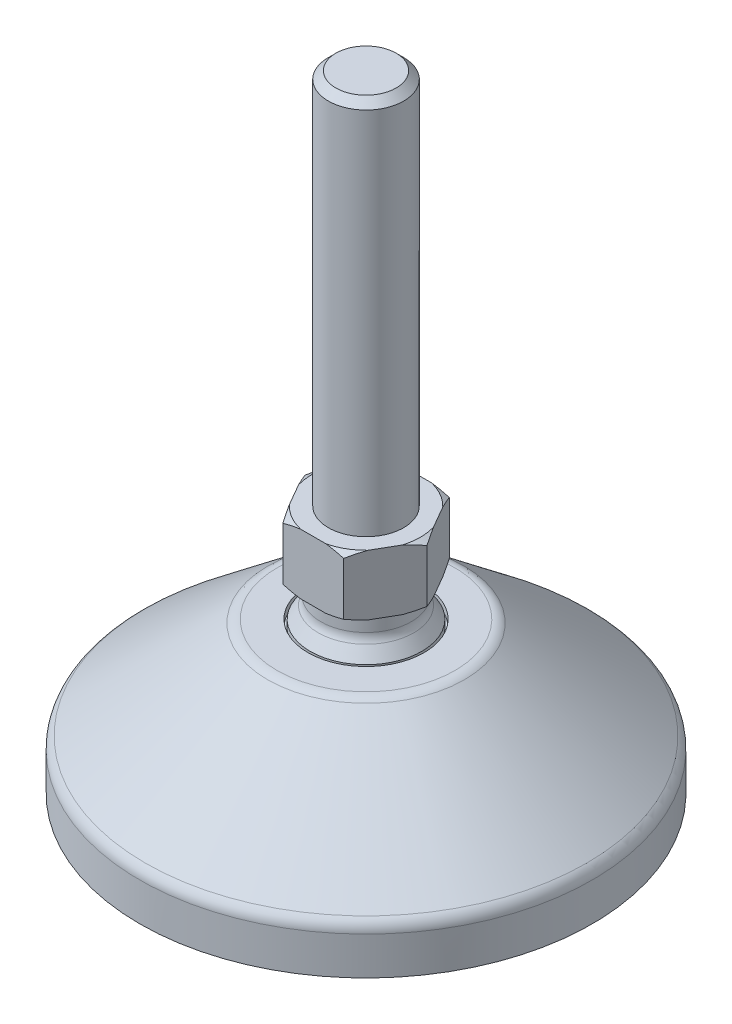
from build123d import *

# Parameters (mm, degrees)
SKETCH1_R           = 25.75
BOSS_EXTRUDE1_DEPTH = 2
SKETCH2_R           = 30
BOSS_EXTRUDE2_DEPTH = 6
SKETCH3_R           = 12.5
SKETCH4_R           = 7.4
SKETCH5_R           = 6
SKETCH11_R          = 7.7
SKETCH11_R_2        = 7.4
CUT_EXTRUDE1_DEPTH  = 1
SKETCH6_R           = 6
BOSS_EXTRUDE3_DEPTH = 2.9
SKETCH7_R           = 5
BOSS_EXTRUDE4_DEPTH = 58
SKETCH8_R           = 5
BOSS_EXTRUDE5_DEPTH = 8
CHAMFER1_SIZE       = 1
BOSS_EXTRUDE6_DEPTH = 1
FILLET1_R           = 2
FILLET2_R           = 2
FILLET3_R           = 1


with BuildPart() as part:
    # Sketch1 → Boss-Extrude1 (new body)
    with BuildSketch(Plane(origin=(0, 0, 0), x_dir=(1, 0, 0), z_dir=(0, 1, 0))):
        with Locations(Location((0, 0, 0), (0, 0, 270))):
            Circle(SKETCH1_R)
    extrude(amount=BOSS_EXTRUDE1_DEPTH)

    # Sketch2 → Boss-Extrude2 (add)
    with BuildSketch(Plane(origin=(0, 2, 0), x_dir=(1, 0, 0), z_dir=(0, 1, 0))):
        with Locations(Location((0, 0, 0), (0, 0, 270))):
            Circle(SKETCH2_R)
    extrude(amount=BOSS_EXTRUDE2_DEPTH)

    # Sketch3 → section 1 of loft1
    with BuildSketch(Plane(origin=(0, 22, 0), x_dir=(1, 0, 0), z_dir=(0, 1, 0)), mode=Mode.PRIVATE) as loft1_s1:
        Circle(SKETCH3_R)
    # loft up to a face of the part (loft1)
    loft([Face(Wire([part.edges().sort_by_distance((21.869058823, 8, -20.536413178))[0]])), loft1_s1.sketch])

    # Sketch4 → Loft2 section 0
    with BuildSketch(Plane(origin=(0, 22, 0), x_dir=(1, 0, 0), z_dir=(0, 1, 0))):
        Circle(SKETCH4_R)
    # Sketch5 → Loft2 section 1
    with BuildSketch(Plane(origin=(0, 24.1, 0), x_dir=(1, 0, 0), z_dir=(0, 1, 0))):
        Circle(SKETCH5_R)
    loft()

    # Sketch11 → Cut-Extrude1 (cut)
    with BuildSketch(Plane(origin=(0, 22, 0), x_dir=(1, 0, 0), z_dir=(0, 1, 0))):
        with Locations(Location((0, 0, 0), (0, 0, 270))):
            Circle(SKETCH11_R)
        with Locations(Location((0, 0, 0), (0, 0, 270))):
            Circle(SKETCH11_R_2, mode=Mode.SUBTRACT)
    extrude(amount=-CUT_EXTRUDE1_DEPTH, mode=Mode.SUBTRACT)

    # Sketch6 → Boss-Extrude3 (add)
    with BuildSketch(Plane(origin=(0, 24.1, 0), x_dir=(1, 0, 0), z_dir=(0, 1, 0))):
        with Locations(Location((0, 0, 0), (0, 0, 270))):
            Circle(SKETCH6_R)
    extrude(amount=BOSS_EXTRUDE3_DEPTH)

    # Sketch7 → Boss-Extrude4 (add)
    with BuildSketch(Plane(origin=(0, 27, 0), x_dir=(1, 0, 0), z_dir=(0, 1, 0))):
        with Locations(Location((0, 0, 0), (0, 0, 90))):
            Circle(SKETCH7_R)
    extrude(amount=BOSS_EXTRUDE4_DEPTH)

    # Sketch8 → Boss-Extrude5 (add)
    with BuildSketch(Plane(origin=(0, 27, 0), x_dir=(1, 0, 0), z_dir=(0, 1, 0))):
        Polygon((8.082903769, 0), (4.041451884, 7), (-4.041451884, 7), (-8.082903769, 0), (-4.041451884, -7), (4.041451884, -7), align=None)
        with Locations(Location((0, 0, 0), (0, 0, 90))):
            Circle(SKETCH8_R, mode=Mode.SUBTRACT)
    extrude(amount=BOSS_EXTRUDE5_DEPTH)

    # Sketch9 → Cut-Revolve1 (revolve, cut)
    with BuildSketch(Plane.XY, mode=Mode.PRIVATE) as cut_revolve1_sk:
        Polygon((-7.2, 35), (-8.082903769, 34.5), (-8.082903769, 35), align=None)
        Polygon((-8.082903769, 27.5), (-7.2, 27), (-8.082903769, 27), align=None)
    revolve(cut_revolve1_sk.sketch.rotate(Axis((0, 85, 0), (0, -1, 0)), 90), axis=Axis((0, 85, 0), (0, -1, 0)), mode=Mode.SUBTRACT)

    # Chamfer1
    chamfer1_edges = [part.edges().sort_by_distance(p)[0] for p in [
        (0, 85, 5),
    ]]
    chamfer(chamfer1_edges, length=CHAMFER1_SIZE)

    # Sketch10 → Boss-Extrude6 (add)
    with BuildSketch(Plane.XZ):
        with BuildLine():
            Line((3, 6), (20.645822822, 6))
            ThreePointArc((20.645822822, 6), (14.079230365, 16.248854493), (3, 21.289668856))
            Line((3, 21.289668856), (3, 6))
        make_face()
        with BuildLine():
            Line((-3, -21.289668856), (-3, -6))
            Line((-3, -6), (-20.645822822, -6))
            ThreePointArc((-20.645822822, -6), (-14.079230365, -16.248854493), (-3, -21.289668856))
        make_face()
        with BuildLine():
            Line((3, -21.289668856), (3, -6))
            Line((3, -6), (20.645822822, -6))
            ThreePointArc((20.645822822, -6), (14.079230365, -16.248854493), (3, -21.289668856))
        make_face()
        with BuildLine():
            Line((-20.645822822, 6), (-3, 6))
            Line((-3, 6), (-3, 21.289668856))
            ThreePointArc((-3, 21.289668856), (-14.079230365, 16.248854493), (-20.645822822, 6))
        make_face()
    extrude(amount=BOSS_EXTRUDE6_DEPTH)

    # Fillet1
    fillet1_edges = [part.edges().sort_by_distance(p)[0] for p in [
        (0, 22, -12.5),
        (0, 8, -30),
    ]]
    fillet(fillet1_edges, radius=FILLET1_R)

    # Fillet2
    fillet2_edges = [part.edges().sort_by_distance(p)[0] for p in [
        (-4.242640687, 24.1, -4.242640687),
    ]]
    fillet(fillet2_edges, radius=FILLET2_R)

    # Fillet3
    fillet3_edges = [part.edges().sort_by_distance(p)[0] for p in [
        (3, -0.5, 21.289668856),
        (3, -0.5, 6),
        (20.645822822, -0.5, 6),
        (-20.645822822, -0.5, -6),
        (-3, -0.5, -21.289668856),
        (-3, -0.5, -6),
        (-3, -0.5, 21.289668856),
        (-20.645822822, -0.5, 6),
        (-3, -0.5, 6),
        (3, -0.5, -21.289668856),
        (20.645822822, -0.5, -6),
        (3, -0.5, -6),
    ]]
    fillet(fillet3_edges, radius=FILLET3_R)


solid = part.part
